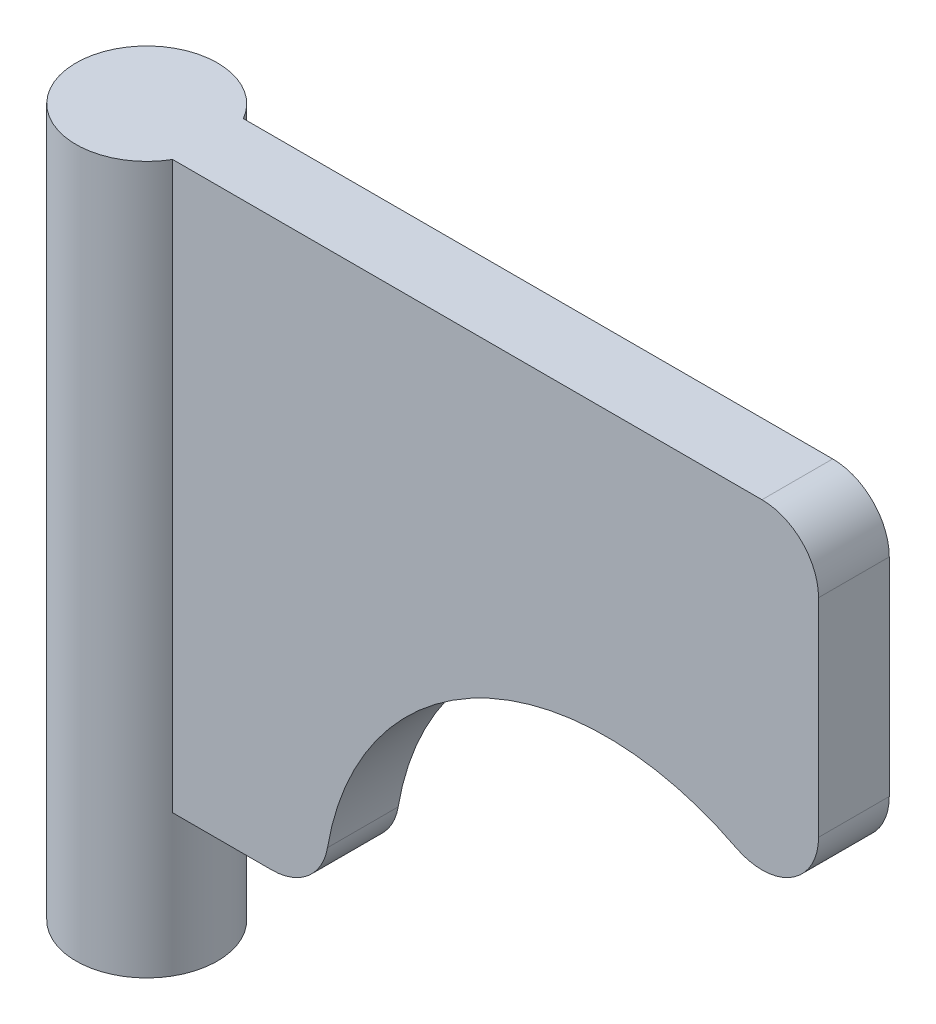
from build123d import *

# Parameters (mm, degrees)
BOSS_EXTRUDE1_DEPTH             = 3.175
SKETCH2_R                       = 3.175
BOSS_EXTRUDE2_DEPTH             = 6.35
BOSS_EXTRUDE2_DIRECTION_2_REACH = 42.784


with BuildPart() as part:
    # Sketch1 → Boss-Extrude1 (new body)
    with BuildSketch(Plane.XY):
        with BuildLine():
            Line((0, 0), (7.198157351, 0))
            ThreePointArc((7.198157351, 0), (8.837720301, 0.600042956), (9.702631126, 2.116666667))
            ThreePointArc((9.702631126, 2.116666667), (16.545762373, 11.359412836), (28.045833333, 11.287510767))
            ThreePointArc((28.045833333, 11.287510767), (30.53185791, 11.376075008), (31.75, 13.54501292))
            Line((31.75, 13.54501292), (31.75, 22.86))
            ThreePointArc((31.75, 22.86), (31.006051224, 24.656051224), (29.21, 25.4))
            Line((29.21, 25.4), (0, 25.4))
            Line((0, 25.4), (0, 0))
        make_face()
    extrude(amount=BOSS_EXTRUDE1_DEPTH)

    # Sketch2 → Boss-Extrude2 (add)
    with BuildSketch(Plane.XZ):
        with Locations(Location((0, 1.5875, 0), (0, 0, 270))):
            Circle(SKETCH2_R)
    extrude(amount=BOSS_EXTRUDE2_DEPTH)

    # Boss-Extrude2 direction 2: up to this face of the body (flat: up to its plane)
    boss_extrude2_direction_2_end = Plane(part.part.faces().sort_by_distance((14.605, 25.4, 1.5875))[0])
    # Sketch2 → Boss-Extrude2 direction 2 (add, up to the picked face)
    with BuildSketch(Plane.XZ, mode=Mode.PRIVATE) as boss_extrude2_direction_2_sk1:
        with Locations(Location((0, 1.5875, 0), (0, 0, 270))):
            Circle(SKETCH2_R)
    boss_extrude2_direction_2_tool1 = split(extrude(boss_extrude2_direction_2_sk1.sketch, amount=-BOSS_EXTRUDE2_DIRECTION_2_REACH, mode=Mode.PRIVATE), bisect_by=boss_extrude2_direction_2_end, keep=Keep.BOTH, mode=Mode.PRIVATE)
    add(boss_extrude2_direction_2_tool1.solids().sort_by(Axis((0, 0, 1.5875), (0, 1, 0)))[0])


solid = part.part
